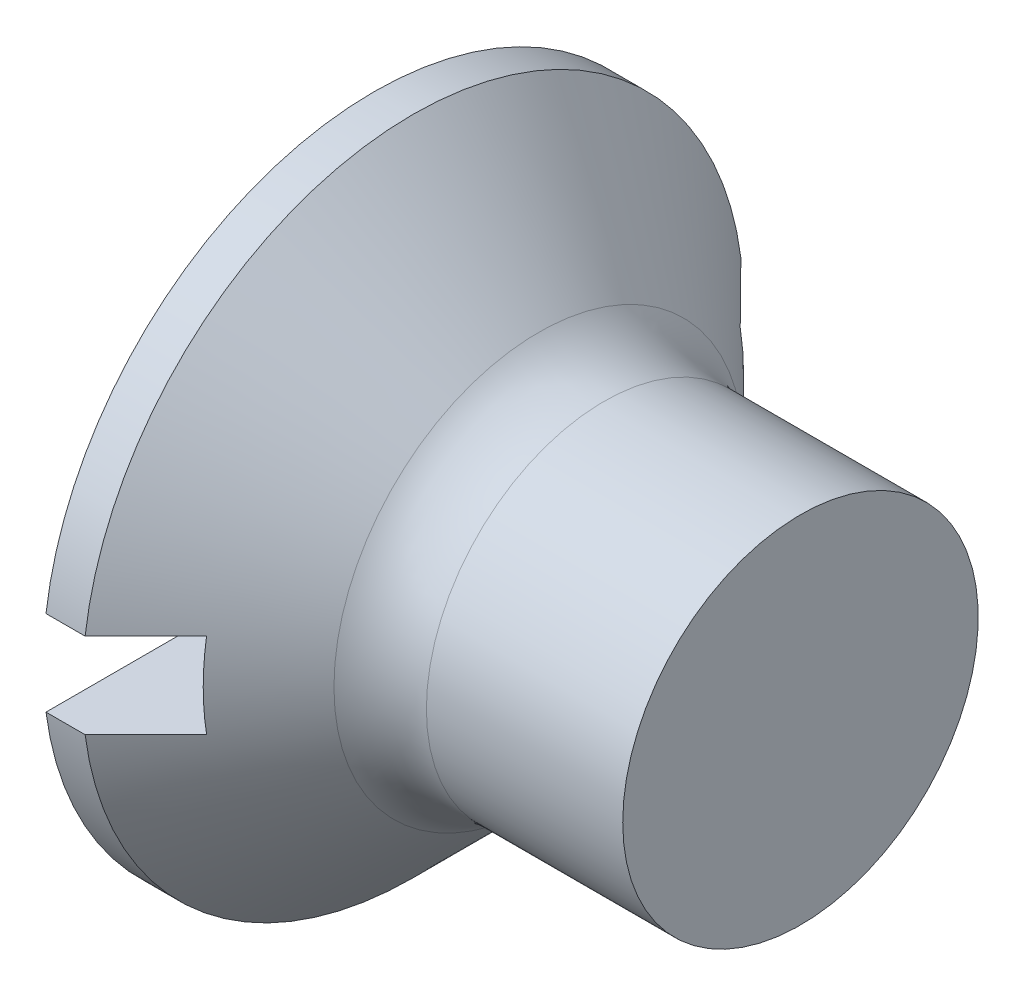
ISO-10303-21;
HEADER;
FILE_DESCRIPTION(('STEP AP214'),'2;1');
FILE_NAME('part.step','',(''),(''),'','','');
FILE_SCHEMA(('AUTOMOTIVE_DESIGN { 1 0 10303 214 1 1 1 1 }'));
ENDSEC;
DATA;
#1=APPLICATION_CONTEXT('core data for automotive mechanical design processes');
#2=APPLICATION_PROTOCOL_DEFINITION('international standard','automotive_design',2000,#1);
#3=PRODUCT_CONTEXT('',#1,'mechanical');
#4=PRODUCT('Part','Part','',(#3));
#5=PRODUCT_RELATED_PRODUCT_CATEGORY('part','',(#4));
#6=PRODUCT_DEFINITION_FORMATION('','',#4);
#7=PRODUCT_DEFINITION_CONTEXT('part definition',#1,'design');
#8=PRODUCT_DEFINITION('design','',#6,#7);
#9=PRODUCT_DEFINITION_SHAPE('','',#8);
#10=(LENGTH_UNIT() NAMED_UNIT(*) SI_UNIT(.MILLI.,.METRE.));
#11=(NAMED_UNIT(*) PLANE_ANGLE_UNIT() SI_UNIT($,.RADIAN.));
#12=(NAMED_UNIT(*) SI_UNIT($,.STERADIAN.) SOLID_ANGLE_UNIT());
#13=UNCERTAINTY_MEASURE_WITH_UNIT(LENGTH_MEASURE(1.E-05),#10,'distance_accuracy_value','');
#14=(GEOMETRIC_REPRESENTATION_CONTEXT(3) GLOBAL_UNCERTAINTY_ASSIGNED_CONTEXT((#13)) GLOBAL_UNIT_ASSIGNED_CONTEXT((#10,
#11,#12)) REPRESENTATION_CONTEXT('',''));
#15=CARTESIAN_POINT('',(0.,0.,0.));
#16=DIRECTION('',(0.,0.,1.));
#17=DIRECTION('',(1.,0.,0.));
#18=AXIS2_PLACEMENT_3D('',#15,#16,#17);
#19=CARTESIAN_POINT('',(-6.34999999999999,0.,0.));
#20=DIRECTION('',(-1.,0.,0.));
#21=DIRECTION('',(0.,0.,1.));
#22=AXIS2_PLACEMENT_3D('',#19,#20,#21);
#23=CYLINDRICAL_SURFACE('',#22,4.65);
#24=DIRECTION('',(-1.,0.,0.));
#25=VECTOR('',#24,1.);
#26=CARTESIAN_POINT('',(-6.34999999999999,0.599999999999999,-4.61112784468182));
#27=LINE('',#26,#25);
#28=CARTESIAN_POINT('',(0.,0.599999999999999,-4.61112784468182));
#29=VERTEX_POINT('',#28);
#30=CARTESIAN_POINT('',(0.550000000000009,0.599999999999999,-4.61112784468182));
#31=VERTEX_POINT('',#30);
#32=EDGE_CURVE('E55',#29,#31,#27,.F.);
#33=ORIENTED_EDGE('',*,*,#32,.F.);
#34=CARTESIAN_POINT('',(0.,0.,0.));
#35=DIRECTION('',(-1.,0.,0.));
#36=DIRECTION('',(0.,0.,1.));
#37=AXIS2_PLACEMENT_3D('',#34,#35,#36);
#38=CIRCLE('',#37,4.65);
#39=CARTESIAN_POINT('',(0.,0.600000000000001,4.61112784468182));
#40=VERTEX_POINT('',#39);
#41=EDGE_CURVE('E102',#40,#29,#38,.T.);
#42=ORIENTED_EDGE('',*,*,#41,.F.);
#43=DIRECTION('',(-1.,0.,0.));
#44=VECTOR('',#43,1.);
#45=CARTESIAN_POINT('',(-6.34999999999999,0.600000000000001,4.61112784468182));
#46=LINE('',#45,#44);
#47=CARTESIAN_POINT('',(0.550000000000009,0.600000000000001,4.61112784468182));
#48=VERTEX_POINT('',#47);
#49=EDGE_CURVE('E143',#48,#40,#46,.T.);
#50=ORIENTED_EDGE('',*,*,#49,.F.);
#51=CARTESIAN_POINT('',(0.550000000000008,0.,0.));
#52=DIRECTION('',(-1.,0.,0.));
#53=DIRECTION('',(0.,0.,1.));
#54=AXIS2_PLACEMENT_3D('',#51,#52,#53);
#55=CIRCLE('',#54,4.65);
#56=EDGE_CURVE('E111',#48,#31,#55,.T.);
#57=ORIENTED_EDGE('',*,*,#56,.T.);
#58=EDGE_LOOP('',(#33,#42,#50,#57));
#59=FACE_BOUND('',#58,.T.);
#60=ADVANCED_FACE('F32',(#59),#23,.T.);
#61=CARTESIAN_POINT('',(0.,0.,0.));
#62=DIRECTION('',(-1.,0.,0.));
#63=DIRECTION('',(0.,0.,1.));
#64=AXIS2_PLACEMENT_3D('',#61,#62,#63);
#65=PLANE('',#64);
#66=DIRECTION('',(0.,0.,-1.));
#67=VECTOR('',#66,1.);
#68=CARTESIAN_POINT('',(0.,0.6,0.));
#69=LINE('',#68,#67);
#70=EDGE_CURVE('E89',#40,#29,#69,.T.);
#71=ORIENTED_EDGE('',*,*,#70,.F.);
#72=ORIENTED_EDGE('',*,*,#41,.T.);
#73=EDGE_LOOP('',(#71,#72));
#74=FACE_BOUND('',#73,.T.);
#75=ADVANCED_FACE('F160',(#74),#65,.T.);
#76=CARTESIAN_POINT('',(6.,2.5,0.));
#77=DIRECTION('',(1.,0.,0.));
#78=DIRECTION('',(0.,0.,-1.));
#79=AXIS2_PLACEMENT_3D('',#76,#77,#78);
#80=PLANE('',#79);
#81=CARTESIAN_POINT('',(6.,0.,0.));
#82=DIRECTION('',(-1.,0.,0.));
#83=DIRECTION('',(0.,0.,1.));
#84=AXIS2_PLACEMENT_3D('',#81,#82,#83);
#85=CIRCLE('',#84,2.5);
#86=CARTESIAN_POINT('',(6.,0.,2.5));
#87=VERTEX_POINT('',#86);
#88=EDGE_CURVE('E112',#87,#87,#85,.T.);
#89=ORIENTED_EDGE('',*,*,#88,.F.);
#90=EDGE_LOOP('',(#89));
#91=FACE_BOUND('',#90,.T.);
#92=ADVANCED_FACE('F171',(#91),#80,.T.);
#93=CARTESIAN_POINT('',(-6.34999999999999,0.,0.));
#94=DIRECTION('',(-1.,0.,0.));
#95=DIRECTION('',(0.,0.,1.));
#96=AXIS2_PLACEMENT_3D('',#93,#94,#95);
#97=CYLINDRICAL_SURFACE('',#96,2.5);
#98=CARTESIAN_POINT('',(3.23847763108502,0.,0.));
#99=DIRECTION('',(-1.,0.,0.));
#100=DIRECTION('',(0.,0.,1.));
#101=AXIS2_PLACEMENT_3D('',#98,#99,#100);
#102=CIRCLE('',#101,2.5);
#103=CARTESIAN_POINT('',(3.23847763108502,0.,2.5));
#104=VERTEX_POINT('',#103);
#105=EDGE_CURVE('E90',#104,#104,#102,.F.);
#106=ORIENTED_EDGE('',*,*,#105,.T.);
#107=EDGE_LOOP('',(#106));
#108=FACE_BOUND('',#107,.T.);
#109=ORIENTED_EDGE('',*,*,#88,.T.);
#110=EDGE_LOOP('',(#109));
#111=FACE_BOUND('',#110,.T.);
#112=ADVANCED_FACE('F165',(#108,#111),#97,.T.);
#113=CARTESIAN_POINT('',(0.550000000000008,0.,0.));
#114=DIRECTION('',(-1.,0.,0.));
#115=DIRECTION('',(0.,0.,1.));
#116=AXIS2_PLACEMENT_3D('',#113,#114,#115);
#117=CONICAL_SURFACE('',#116,4.65,0.78539816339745);
#118=CARTESIAN_POINT('',(-5.05345798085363,0.599999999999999,-10.2358878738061));
#119=CARTESIAN_POINT('',(-4.7063338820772,0.599999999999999,-9.88816346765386));
#120=CARTESIAN_POINT('',(-4.35923588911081,0.599999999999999,-9.54041298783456));
#121=CARTESIAN_POINT('',(-3.66512028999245,0.599999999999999,-8.84482295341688));
#122=CARTESIAN_POINT('',(-3.31810268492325,0.599999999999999,-8.49698339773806));
#123=CARTESIAN_POINT('',(-2.6240861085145,0.599999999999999,-7.80108810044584));
#124=CARTESIAN_POINT('',(-2.27708717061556,0.599999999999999,-7.45303232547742));
#125=CARTESIAN_POINT('',(-1.58327190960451,0.599999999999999,-6.75674744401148));
#126=CARTESIAN_POINT('',(-1.23645558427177,0.599999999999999,-6.40851833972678));
#127=CARTESIAN_POINT('',(-0.530234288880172,0.599999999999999,-5.69884909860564));
#128=CARTESIAN_POINT('',(-0.170839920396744,0.599999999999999,-5.3373984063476));
#129=CARTESIAN_POINT('',(0.367846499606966,0.599999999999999,-4.79480605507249));
#130=CARTESIAN_POINT('',(0.547344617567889,0.599999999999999,-4.61386901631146));
#131=CARTESIAN_POINT('',(0.906142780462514,0.599999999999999,-4.251800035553));
#132=CARTESIAN_POINT('',(1.08544282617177,0.6,-4.07066809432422));
#133=CARTESIAN_POINT('',(1.44372217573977,0.6,-3.70815209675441));
#134=CARTESIAN_POINT('',(1.62270153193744,0.6,-3.52676809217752));
#135=CARTESIAN_POINT('',(1.98021132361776,0.6,-3.16355280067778));
#136=CARTESIAN_POINT('',(2.1587417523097,0.6,-2.98172150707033));
#137=CARTESIAN_POINT('',(2.51504600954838,0.6,-2.61734150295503));
#138=CARTESIAN_POINT('',(2.69281988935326,0.6,-2.43479284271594));
#139=CARTESIAN_POINT('',(2.95840184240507,0.6,-2.15993102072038));
#140=CARTESIAN_POINT('',(3.0467482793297,0.6,-2.06813839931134));
#141=CARTESIAN_POINT('',(3.22290791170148,0.6,-1.8840432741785));
#142=CARTESIAN_POINT('',(3.31072111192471,0.6,-1.79174077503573));
#143=CARTESIAN_POINT('',(3.44507973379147,0.6,-1.64924720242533));
#144=CARTESIAN_POINT('',(3.49191887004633,0.6,-1.59933324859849));
#145=CARTESIAN_POINT('',(3.58528403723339,0.6,-1.49921165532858));
#146=CARTESIAN_POINT('',(3.63181006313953,0.6,-1.44900401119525));
#147=CARTESIAN_POINT('',(3.72427703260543,0.6,-1.348388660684));
#148=CARTESIAN_POINT('',(3.77021949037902,0.6,-1.29798234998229));
#149=CARTESIAN_POINT('',(3.86152904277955,0.6,-1.19665513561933));
#150=CARTESIAN_POINT('',(3.90689615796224,0.6,-1.1457342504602));
#151=CARTESIAN_POINT('',(4.01209252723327,0.6,-1.02578570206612));
#152=CARTESIAN_POINT('',(4.07160553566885,0.6,-0.956477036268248));
#153=CARTESIAN_POINT('',(4.15917887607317,0.6,-0.850702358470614));
#154=CARTESIAN_POINT('',(4.18818199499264,0.6,-0.815019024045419));
#155=CARTESIAN_POINT('',(4.24528795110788,0.6,-0.742941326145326));
#156=CARTESIAN_POINT('',(4.27339088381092,0.6,-0.706547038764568));
#157=CARTESIAN_POINT('',(4.32869682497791,0.6,-0.632291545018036));
#158=CARTESIAN_POINT('',(4.35588213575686,0.6,-0.594417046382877));
#159=CARTESIAN_POINT('',(4.40832254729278,0.6,-0.517260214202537));
#160=CARTESIAN_POINT('',(4.43357498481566,0.6,-0.477976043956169));
#161=CARTESIAN_POINT('',(4.48075024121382,0.6,-0.397940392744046));
#162=CARTESIAN_POINT('',(4.50270366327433,0.6,-0.357207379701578));
#163=CARTESIAN_POINT('',(4.54164745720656,0.6,-0.273493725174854));
#164=CARTESIAN_POINT('',(4.55865364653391,0.6,-0.230520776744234));
#165=CARTESIAN_POINT('',(4.58372379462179,0.6,-0.145820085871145));
#166=CARTESIAN_POINT('',(4.59242377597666,0.6,-0.104295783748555));
#167=CARTESIAN_POINT('',(4.59893532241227,0.6,-0.0414391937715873));
#168=CARTESIAN_POINT('',(4.60002000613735,0.6,-0.0204304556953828));
#169=CARTESIAN_POINT('',(4.59997943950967,0.6,0.0215839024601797));
#170=CARTESIAN_POINT('',(4.59885411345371,0.6,0.0425895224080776));
#171=CARTESIAN_POINT('',(4.59227145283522,0.6,0.10501520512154));
#172=CARTESIAN_POINT('',(4.58363501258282,0.6,0.1461245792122));
#173=CARTESIAN_POINT('',(4.565808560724,0.6,0.206345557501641));
#174=CARTESIAN_POINT('',(4.55901965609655,0.6,0.226250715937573));
#175=CARTESIAN_POINT('',(4.54410905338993,0.6,0.265557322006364));
#176=CARTESIAN_POINT('',(4.53598757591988,0.6,0.284958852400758));
#177=CARTESIAN_POINT('',(4.51162458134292,0.6,0.33886087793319));
#178=CARTESIAN_POINT('',(4.49415337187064,0.6,0.372800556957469));
#179=CARTESIAN_POINT('',(4.45684225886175,0.6,0.439365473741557));
#180=CARTESIAN_POINT('',(4.436999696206,0.6,0.471989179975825));
#181=CARTESIAN_POINT('',(4.39563171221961,0.6,0.53629862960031));
#182=CARTESIAN_POINT('',(4.37410080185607,0.6,0.567980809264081));
#183=CARTESIAN_POINT('',(4.32989042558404,0.6,0.630537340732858));
#184=CARTESIAN_POINT('',(4.30721068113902,0.6,0.661411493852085));
#185=CARTESIAN_POINT('',(4.23751211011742,0.6,0.753681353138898));
#186=CARTESIAN_POINT('',(4.18923822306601,0.6,0.814124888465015));
#187=CARTESIAN_POINT('',(4.0909576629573,0.6,0.933321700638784));
#188=CARTESIAN_POINT('',(4.04095530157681,0.6,0.992078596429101));
#189=CARTESIAN_POINT('',(3.94086297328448,0.6,1.10735067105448));
#190=CARTESIAN_POINT('',(3.89079728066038,0.6,1.16388697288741));
#191=CARTESIAN_POINT('',(3.78992367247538,0.6,1.27629304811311));
#192=CARTESIAN_POINT('',(3.73911573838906,0.6,1.33216280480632));
#193=CARTESIAN_POINT('',(3.58591315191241,0.6,1.49908452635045));
#194=CARTESIAN_POINT('',(3.4827535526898,0.6,1.609433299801));
#195=CARTESIAN_POINT('',(3.27521830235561,0.6,1.82922471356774));
#196=CARTESIAN_POINT('',(3.17084134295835,0.6,1.93866611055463));
#197=CARTESIAN_POINT('',(2.96141984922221,0.6,2.15689179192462));
#198=CARTESIAN_POINT('',(2.85637536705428,0.6,2.26567612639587));
#199=CARTESIAN_POINT('',(2.64692360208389,0.6,2.481710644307));
#200=CARTESIAN_POINT('',(2.5425207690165,0.6,2.58896514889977));
#201=CARTESIAN_POINT('',(2.33341496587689,0.6,2.80318525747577));
#202=CARTESIAN_POINT('',(2.22871198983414,0.6,2.91015085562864));
#203=CARTESIAN_POINT('',(1.91438863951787,0.6,3.23063427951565));
#204=CARTESIAN_POINT('',(1.70445280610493,0.6,3.44384256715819));
#205=CARTESIAN_POINT('',(1.22510768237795,0.6,3.9295930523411));
#206=CARTESIAN_POINT('',(0.955548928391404,0.600000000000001,4.20198758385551));
#207=CARTESIAN_POINT('',(0.416004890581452,0.600000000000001,4.74635530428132));
#208=CARTESIAN_POINT('',(0.146019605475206,0.600000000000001,5.01832849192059));
#209=CARTESIAN_POINT('',(-0.664426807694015,0.600000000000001,5.83398149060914));
#210=CARTESIAN_POINT('',(-1.2052682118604,0.600000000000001,6.37728333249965));
#211=CARTESIAN_POINT('',(-2.297244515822,0.600000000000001,7.47334328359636));
#212=CARTESIAN_POINT('',(-2.84838746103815,0.600000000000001,8.02609337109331));
#213=CARTESIAN_POINT('',(-3.95082527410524,0.600000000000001,9.1312059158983));
#214=CARTESIAN_POINT('',(-4.5021200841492,0.600000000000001,9.683568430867));
#215=CARTESIAN_POINT('',(-5.05345798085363,0.600000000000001,10.2358878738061));
#216=B_SPLINE_CURVE_WITH_KNOTS('',3,(#118,#119,#120,#121,#122,#123,#124,#125,#126,#127,#128,
#129,#130,#131,#132,#133,#134,#135,#136,#137,#138,#139,#140,#141,#142,#143,#144,#145,#146,#147,
#148,#149,#150,#151,#152,#153,#154,#155,#156,#157,#158,#159,#160,#161,#162,#163,#164,#165,#166,
#167,#168,#169,#170,#171,#172,#173,#174,#175,#176,#177,#178,#179,#180,#181,#182,#183,#184,#185,
#186,#187,#188,#189,#190,#191,#192,#193,#194,#195,#196,#197,#198,#199,#200,#201,#202,#203,#204,
#205,#206,#207,#208,#209,#210,#211,#212,#213,#214,#215),.UNSPECIFIED.,.F.,.F.,(4,2,2,2,2,2,2,2,
2,2,2,2,2,2,2,2,2,2,2,2,2,2,2,2,2,2,2,2,2,2,2,2,2,2,2,2,2,2,2,2,2,2,2,2,2,2,2,2,4),(0.,
1.47399683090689,2.94801247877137,4.4224478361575,5.89686482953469,7.42601395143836,
8.19061836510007,8.95521977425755,9.71968231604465,10.4841563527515,11.2485777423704,
11.630779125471,12.0129770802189,12.2183239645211,12.4236741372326,12.6282760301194,
12.8328705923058,13.1068888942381,13.2448295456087,13.3827555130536,13.522578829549,
13.6625914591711,13.8012122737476,13.9393848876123,14.0658401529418,14.1288404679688,
14.1918429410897,14.3170190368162,14.3800826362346,14.4431358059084,14.557498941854,
14.6719915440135,14.7868731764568,14.9017827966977,15.1337679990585,15.365211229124,
15.5917537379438,15.8183019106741,16.2714608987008,16.7251625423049,17.1788291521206,
17.6278622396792,18.076904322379,18.9745538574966,20.1242253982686,21.2739004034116,
23.5737206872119,25.9154338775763,28.2566456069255),.UNSPECIFIED.);
#217=CARTESIAN_POINT('',(1.4,0.6,3.75233260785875));
#218=VERTEX_POINT('',#217);
#219=EDGE_CURVE('E107',#218,#48,#216,.T.);
#220=ORIENTED_EDGE('',*,*,#219,.F.);
#221=CARTESIAN_POINT('',(1.4,0.,0.));
#222=DIRECTION('',(1.,0.,0.));
#223=DIRECTION('',(0.,0.,-1.));
#224=AXIS2_PLACEMENT_3D('',#221,#222,#223);
#225=CIRCLE('',#224,3.80000000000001);
#226=CARTESIAN_POINT('',(1.4,-0.600000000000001,3.75233260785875));
#227=VERTEX_POINT('',#226);
#228=EDGE_CURVE('E11',#227,#218,#225,.F.);
#229=ORIENTED_EDGE('',*,*,#228,.F.);
#230=CARTESIAN_POINT('',(-5.05345798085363,-0.600000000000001,10.2358878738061));
#231=CARTESIAN_POINT('',(-4.7063338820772,-0.600000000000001,9.88816346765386));
#232=CARTESIAN_POINT('',(-4.35923588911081,-0.600000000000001,9.54041298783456));
#233=CARTESIAN_POINT('',(-3.66512028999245,-0.600000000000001,8.84482295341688));
#234=CARTESIAN_POINT('',(-3.31810268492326,-0.600000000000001,8.49698339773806));
#235=CARTESIAN_POINT('',(-2.6240861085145,-0.600000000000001,7.80108810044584));
#236=CARTESIAN_POINT('',(-2.27708717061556,-0.600000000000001,7.45303232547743));
#237=CARTESIAN_POINT('',(-1.58327190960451,-0.600000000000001,6.75674744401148));
#238=CARTESIAN_POINT('',(-1.23645558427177,-0.600000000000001,6.40851833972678));
#239=CARTESIAN_POINT('',(-0.530234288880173,-0.600000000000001,5.69884909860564));
#240=CARTESIAN_POINT('',(-0.170839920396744,-0.600000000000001,5.3373984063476));
#241=CARTESIAN_POINT('',(0.367846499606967,-0.600000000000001,4.79480605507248));
#242=CARTESIAN_POINT('',(0.547344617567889,-0.600000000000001,4.61386901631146));
#243=CARTESIAN_POINT('',(0.906142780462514,-0.600000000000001,4.251800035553));
#244=CARTESIAN_POINT('',(1.08544282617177,-0.600000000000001,4.07066809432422));
#245=CARTESIAN_POINT('',(1.44372217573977,-0.600000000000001,3.70815209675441));
#246=CARTESIAN_POINT('',(1.62270153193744,-0.600000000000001,3.52676809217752));
#247=CARTESIAN_POINT('',(1.98021132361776,-0.600000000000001,3.16355280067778));
#248=CARTESIAN_POINT('',(2.1587417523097,-0.600000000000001,2.98172150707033));
#249=CARTESIAN_POINT('',(2.51504600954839,-0.600000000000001,2.61734150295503));
#250=CARTESIAN_POINT('',(2.69281988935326,-0.600000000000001,2.43479284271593));
#251=CARTESIAN_POINT('',(2.95840184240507,-0.600000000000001,2.15993102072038));
#252=CARTESIAN_POINT('',(3.0467482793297,-0.600000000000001,2.06813839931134));
#253=CARTESIAN_POINT('',(3.22290791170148,-0.600000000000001,1.8840432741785));
#254=CARTESIAN_POINT('',(3.31072111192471,-0.600000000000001,1.79174077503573));
#255=CARTESIAN_POINT('',(3.44507973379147,-0.600000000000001,1.64924720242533));
#256=CARTESIAN_POINT('',(3.49191887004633,-0.600000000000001,1.59933324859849));
#257=CARTESIAN_POINT('',(3.58528403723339,-0.600000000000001,1.49921165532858));
#258=CARTESIAN_POINT('',(3.63181006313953,-0.600000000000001,1.44900401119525));
#259=CARTESIAN_POINT('',(3.72427703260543,-0.600000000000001,1.348388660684));
#260=CARTESIAN_POINT('',(3.77021949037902,-0.600000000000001,1.29798234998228));
#261=CARTESIAN_POINT('',(3.86152904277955,-0.600000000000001,1.19665513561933));
#262=CARTESIAN_POINT('',(3.90689615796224,-0.600000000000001,1.1457342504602));
#263=CARTESIAN_POINT('',(4.01209252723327,-0.600000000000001,1.02578570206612));
#264=CARTESIAN_POINT('',(4.07160553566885,-0.600000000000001,0.956477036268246));
#265=CARTESIAN_POINT('',(4.15917887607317,-0.600000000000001,0.850702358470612));
#266=CARTESIAN_POINT('',(4.18818199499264,-0.600000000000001,0.815019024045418));
#267=CARTESIAN_POINT('',(4.24528795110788,-0.600000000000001,0.742941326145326));
#268=CARTESIAN_POINT('',(4.27339088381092,-0.600000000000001,0.706547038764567));
#269=CARTESIAN_POINT('',(4.32869682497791,-0.600000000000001,0.632291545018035));
#270=CARTESIAN_POINT('',(4.35588213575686,-0.600000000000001,0.594417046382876));
#271=CARTESIAN_POINT('',(4.40832254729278,-0.600000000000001,0.517260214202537));
#272=CARTESIAN_POINT('',(4.43357498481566,-0.600000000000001,0.477976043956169));
#273=CARTESIAN_POINT('',(4.48075024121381,-0.600000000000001,0.397940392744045));
#274=CARTESIAN_POINT('',(4.50270366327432,-0.600000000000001,0.357207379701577));
#275=CARTESIAN_POINT('',(4.54164745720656,-0.600000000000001,0.273493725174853));
#276=CARTESIAN_POINT('',(4.55865364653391,-0.600000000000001,0.230520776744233));
#277=CARTESIAN_POINT('',(4.58372379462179,-0.600000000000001,0.145820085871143));
#278=CARTESIAN_POINT('',(4.59242377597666,-0.600000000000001,0.104295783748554));
#279=CARTESIAN_POINT('',(4.59893532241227,-0.600000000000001,0.0414391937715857));
#280=CARTESIAN_POINT('',(4.60002000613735,-0.600000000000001,0.0204304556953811));
#281=CARTESIAN_POINT('',(4.59997943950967,-0.600000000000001,-0.0215839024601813));
#282=CARTESIAN_POINT('',(4.59885411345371,-0.600000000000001,-0.0425895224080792));
#283=CARTESIAN_POINT('',(4.59227145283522,-0.600000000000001,-0.105015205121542));
#284=CARTESIAN_POINT('',(4.58363501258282,-0.600000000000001,-0.146124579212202));
#285=CARTESIAN_POINT('',(4.565808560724,-0.600000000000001,-0.206345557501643));
#286=CARTESIAN_POINT('',(4.55901965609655,-0.600000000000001,-0.226250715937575));
#287=CARTESIAN_POINT('',(4.54410905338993,-0.600000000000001,-0.265557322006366));
#288=CARTESIAN_POINT('',(4.53598757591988,-0.600000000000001,-0.284958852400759));
#289=CARTESIAN_POINT('',(4.51162458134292,-0.600000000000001,-0.338860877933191));
#290=CARTESIAN_POINT('',(4.49415337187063,-0.600000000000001,-0.37280055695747));
#291=CARTESIAN_POINT('',(4.45684225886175,-0.600000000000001,-0.439365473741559));
#292=CARTESIAN_POINT('',(4.43699969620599,-0.600000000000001,-0.471989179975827));
#293=CARTESIAN_POINT('',(4.3956317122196,-0.600000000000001,-0.536298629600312));
#294=CARTESIAN_POINT('',(4.37410080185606,-0.600000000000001,-0.567980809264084));
#295=CARTESIAN_POINT('',(4.32989042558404,-0.600000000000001,-0.630537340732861));
#296=CARTESIAN_POINT('',(4.30721068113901,-0.600000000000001,-0.661411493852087));
#297=CARTESIAN_POINT('',(4.23751211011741,-0.600000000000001,-0.753681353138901));
#298=CARTESIAN_POINT('',(4.18923822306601,-0.600000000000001,-0.814124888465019));
#299=CARTESIAN_POINT('',(4.09095766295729,-0.600000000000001,-0.933321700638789));
#300=CARTESIAN_POINT('',(4.04095530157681,-0.600000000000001,-0.992078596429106));
#301=CARTESIAN_POINT('',(3.94086297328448,-0.600000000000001,-1.10735067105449));
#302=CARTESIAN_POINT('',(3.89079728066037,-0.600000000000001,-1.16388697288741));
#303=CARTESIAN_POINT('',(3.78992367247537,-0.600000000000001,-1.27629304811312));
#304=CARTESIAN_POINT('',(3.73911573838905,-0.600000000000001,-1.33216280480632));
#305=CARTESIAN_POINT('',(3.5859131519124,-0.600000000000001,-1.49908452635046));
#306=CARTESIAN_POINT('',(3.48275355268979,-0.600000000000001,-1.60943329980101));
#307=CARTESIAN_POINT('',(3.2752183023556,-0.600000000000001,-1.82922471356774));
#308=CARTESIAN_POINT('',(3.17084134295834,-0.600000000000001,-1.93866611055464));
#309=CARTESIAN_POINT('',(2.9614198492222,-0.600000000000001,-2.15689179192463));
#310=CARTESIAN_POINT('',(2.85637536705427,-0.600000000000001,-2.26567612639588));
#311=CARTESIAN_POINT('',(2.64692360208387,-0.600000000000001,-2.48171064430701));
#312=CARTESIAN_POINT('',(2.54252076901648,-0.600000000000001,-2.58896514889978));
#313=CARTESIAN_POINT('',(2.33341496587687,-0.600000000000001,-2.80318525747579));
#314=CARTESIAN_POINT('',(2.22871198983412,-0.600000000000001,-2.91015085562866));
#315=CARTESIAN_POINT('',(1.91438863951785,-0.600000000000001,-3.23063427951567));
#316=CARTESIAN_POINT('',(1.70445280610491,-0.600000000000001,-3.44384256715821));
#317=CARTESIAN_POINT('',(1.22510768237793,-0.600000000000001,-3.92959305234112));
#318=CARTESIAN_POINT('',(0.955548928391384,-0.600000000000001,-4.20198758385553));
#319=CARTESIAN_POINT('',(0.416004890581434,-0.600000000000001,-4.74635530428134));
#320=CARTESIAN_POINT('',(0.146019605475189,-0.600000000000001,-5.01832849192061));
#321=CARTESIAN_POINT('',(-0.66442680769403,-0.600000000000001,-5.83398149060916));
#322=CARTESIAN_POINT('',(-1.20526821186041,-0.600000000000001,-6.37728333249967));
#323=CARTESIAN_POINT('',(-2.29724451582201,-0.600000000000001,-7.47334328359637));
#324=CARTESIAN_POINT('',(-2.84838746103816,-0.600000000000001,-8.02609337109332));
#325=CARTESIAN_POINT('',(-3.95082527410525,-0.600000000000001,-9.13120591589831));
#326=CARTESIAN_POINT('',(-4.5021200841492,-0.600000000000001,-9.68356843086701));
#327=CARTESIAN_POINT('',(-5.05345798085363,-0.600000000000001,-10.2358878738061));
#328=B_SPLINE_CURVE_WITH_KNOTS('',3,(#230,#231,#232,#233,#234,#235,#236,#237,#238,#239,#240,
#241,#242,#243,#244,#245,#246,#247,#248,#249,#250,#251,#252,#253,#254,#255,#256,#257,#258,#259,
#260,#261,#262,#263,#264,#265,#266,#267,#268,#269,#270,#271,#272,#273,#274,#275,#276,#277,#278,
#279,#280,#281,#282,#283,#284,#285,#286,#287,#288,#289,#290,#291,#292,#293,#294,#295,#296,#297,
#298,#299,#300,#301,#302,#303,#304,#305,#306,#307,#308,#309,#310,#311,#312,#313,#314,#315,#316,
#317,#318,#319,#320,#321,#322,#323,#324,#325,#326,#327),.UNSPECIFIED.,.F.,.F.,(4,2,2,2,2,2,2,2,
2,2,2,2,2,2,2,2,2,2,2,2,2,2,2,2,2,2,2,2,2,2,2,2,2,2,2,2,2,2,2,2,2,2,2,2,2,2,2,2,4),(0.,
1.47399683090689,2.94801247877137,4.4224478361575,5.89686482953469,7.42601395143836,
8.19061836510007,8.95521977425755,9.71968231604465,10.4841563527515,11.2485777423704,
11.630779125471,12.0129770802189,12.2183239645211,12.4236741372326,12.6282760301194,
12.8328705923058,13.1068888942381,13.2448295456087,13.3827555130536,13.522578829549,
13.6625914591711,13.8012122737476,13.9393848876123,14.0658401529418,14.1288404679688,
14.1918429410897,14.3170190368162,14.3800826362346,14.4431358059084,14.557498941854,
14.6719915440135,14.7868731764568,14.9017827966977,15.1337679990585,15.365211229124,
15.5917537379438,15.8183019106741,16.2714608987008,16.7251625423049,17.1788291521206,
17.6278622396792,18.076904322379,18.9745538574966,20.1242253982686,21.2739004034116,
23.5737206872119,25.9154338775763,28.2566456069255),.UNSPECIFIED.);
#329=CARTESIAN_POINT('',(0.550000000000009,-0.600000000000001,4.61112784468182));
#330=VERTEX_POINT('',#329);
#331=EDGE_CURVE('E98',#330,#227,#328,.T.);
#332=ORIENTED_EDGE('',*,*,#331,.F.);
#333=CARTESIAN_POINT('',(0.550000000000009,-0.600000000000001,-4.61112784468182));
#334=VERTEX_POINT('',#333);
#335=EDGE_CURVE('E97',#334,#330,#55,.T.);
#336=ORIENTED_EDGE('',*,*,#335,.F.);
#337=CARTESIAN_POINT('',(1.4,-0.600000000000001,-3.75233260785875));
#338=VERTEX_POINT('',#337);
#339=EDGE_CURVE('E99',#338,#334,#328,.T.);
#340=ORIENTED_EDGE('',*,*,#339,.F.);
#341=CARTESIAN_POINT('',(1.4,0.6,-3.75233260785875));
#342=VERTEX_POINT('',#341);
#343=EDGE_CURVE('E36',#342,#338,#225,.F.);
#344=ORIENTED_EDGE('',*,*,#343,.F.);
#345=EDGE_CURVE('E103',#31,#342,#216,.T.);
#346=ORIENTED_EDGE('',*,*,#345,.F.);
#347=ORIENTED_EDGE('',*,*,#56,.F.);
#348=EDGE_LOOP('',(#220,#229,#332,#336,#340,#344,#346,#347));
#349=FACE_BOUND('',#348,.T.);
#350=CARTESIAN_POINT('',(2.31923881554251,0.,0.));
#351=DIRECTION('',(-1.,0.,0.));
#352=DIRECTION('',(0.,0.,1.));
#353=AXIS2_PLACEMENT_3D('',#350,#351,#352);
#354=CIRCLE('',#353,2.88076118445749);
#355=CARTESIAN_POINT('',(2.31923881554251,0.,2.88076118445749));
#356=VERTEX_POINT('',#355);
#357=EDGE_CURVE('E115',#356,#356,#354,.T.);
#358=ORIENTED_EDGE('',*,*,#357,.T.);
#359=EDGE_LOOP('',(#358));
#360=FACE_BOUND('',#359,.T.);
#361=ADVANCED_FACE('F134',(#349,#360),#117,.T.);
#362=DIRECTION('',(-1.,0.,0.));
#363=VECTOR('',#362,1.);
#364=CARTESIAN_POINT('',(-6.34999999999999,-0.600000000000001,4.61112784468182));
#365=LINE('',#364,#363);
#366=CARTESIAN_POINT('',(0.,-0.600000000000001,4.61112784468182));
#367=VERTEX_POINT('',#366);
#368=EDGE_CURVE('E84',#367,#330,#365,.F.);
#369=ORIENTED_EDGE('',*,*,#368,.F.);
#370=CARTESIAN_POINT('',(0.,-0.600000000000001,-4.61112784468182));
#371=VERTEX_POINT('',#370);
#372=EDGE_CURVE('E95',#371,#367,#38,.T.);
#373=ORIENTED_EDGE('',*,*,#372,.F.);
#374=DIRECTION('',(-1.,0.,0.));
#375=VECTOR('',#374,1.);
#376=CARTESIAN_POINT('',(-6.34999999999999,-0.600000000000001,-4.61112784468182));
#377=LINE('',#376,#375);
#378=EDGE_CURVE('E47',#334,#371,#377,.T.);
#379=ORIENTED_EDGE('',*,*,#378,.F.);
#380=ORIENTED_EDGE('',*,*,#335,.T.);
#381=EDGE_LOOP('',(#369,#373,#379,#380));
#382=FACE_BOUND('',#381,.T.);
#383=ADVANCED_FACE('F94',(#382),#23,.T.);
#384=DIRECTION('',(0.,0.,1.));
#385=VECTOR('',#384,1.);
#386=CARTESIAN_POINT('',(0.,-0.600000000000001,0.));
#387=LINE('',#386,#385);
#388=EDGE_CURVE('E81',#371,#367,#387,.T.);
#389=ORIENTED_EDGE('',*,*,#388,.F.);
#390=ORIENTED_EDGE('',*,*,#372,.T.);
#391=EDGE_LOOP('',(#389,#390));
#392=FACE_BOUND('',#391,.T.);
#393=ADVANCED_FACE('F101',(#392),#65,.T.);
#394=CARTESIAN_POINT('',(3.23847763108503,0.,0.));
#395=DIRECTION('',(-1.,0.,0.));
#396=DIRECTION('',(0.,0.,1.));
#397=AXIS2_PLACEMENT_3D('',#394,#395,#396);
#398=TOROIDAL_SURFACE('',#397,3.8,1.3);
#399=ORIENTED_EDGE('',*,*,#105,.F.);
#400=EDGE_LOOP('',(#399));
#401=FACE_BOUND('',#400,.T.);
#402=ORIENTED_EDGE('',*,*,#357,.F.);
#403=EDGE_LOOP('',(#402));
#404=FACE_BOUND('',#403,.T.);
#405=ADVANCED_FACE('F34',(#401,#404),#398,.F.);
#406=CARTESIAN_POINT('',(1.4,0.600000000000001,4.65));
#407=DIRECTION('',(0.,1.,0.));
#408=DIRECTION('',(0.,0.,1.));
#409=AXIS2_PLACEMENT_3D('',#406,#407,#408);
#410=PLANE('',#409);
#411=ORIENTED_EDGE('',*,*,#345,.T.);
#412=DIRECTION('',(0.,0.,-1.));
#413=VECTOR('',#412,1.);
#414=CARTESIAN_POINT('',(1.4,0.600000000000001,4.65));
#415=LINE('',#414,#413);
#416=EDGE_CURVE('E129',#218,#342,#415,.T.);
#417=ORIENTED_EDGE('',*,*,#416,.F.);
#418=ORIENTED_EDGE('',*,*,#219,.T.);
#419=ORIENTED_EDGE('',*,*,#49,.T.);
#420=ORIENTED_EDGE('',*,*,#70,.T.);
#421=ORIENTED_EDGE('',*,*,#32,.T.);
#422=EDGE_LOOP('',(#411,#417,#418,#419,#420,#421));
#423=FACE_BOUND('',#422,.T.);
#424=ADVANCED_FACE('F153',(#423),#410,.F.);
#425=CARTESIAN_POINT('',(1.4,-0.600000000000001,-4.65));
#426=DIRECTION('',(0.,-1.,0.));
#427=DIRECTION('',(0.,0.,-1.));
#428=AXIS2_PLACEMENT_3D('',#425,#426,#427);
#429=PLANE('',#428);
#430=ORIENTED_EDGE('',*,*,#331,.T.);
#431=DIRECTION('',(0.,0.,1.));
#432=VECTOR('',#431,1.);
#433=CARTESIAN_POINT('',(1.4,-0.600000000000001,-4.65));
#434=LINE('',#433,#432);
#435=EDGE_CURVE('E126',#338,#227,#434,.T.);
#436=ORIENTED_EDGE('',*,*,#435,.F.);
#437=ORIENTED_EDGE('',*,*,#339,.T.);
#438=ORIENTED_EDGE('',*,*,#378,.T.);
#439=ORIENTED_EDGE('',*,*,#388,.T.);
#440=ORIENTED_EDGE('',*,*,#368,.T.);
#441=EDGE_LOOP('',(#430,#436,#437,#438,#439,#440));
#442=FACE_BOUND('',#441,.T.);
#443=ADVANCED_FACE('F83',(#442),#429,.F.);
#444=CARTESIAN_POINT('',(1.4,-0.600000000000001,-4.65));
#445=DIRECTION('',(1.,0.,0.));
#446=DIRECTION('',(0.,0.,-1.));
#447=AXIS2_PLACEMENT_3D('',#444,#445,#446);
#448=PLANE('',#447);
#449=ORIENTED_EDGE('',*,*,#228,.T.);
#450=ORIENTED_EDGE('',*,*,#416,.T.);
#451=ORIENTED_EDGE('',*,*,#343,.T.);
#452=ORIENTED_EDGE('',*,*,#435,.T.);
#453=EDGE_LOOP('',(#449,#450,#451,#452));
#454=FACE_BOUND('',#453,.T.);
#455=ADVANCED_FACE('F125',(#454),#448,.F.);
#456=CLOSED_SHELL('',(#60,#75,#92,#112,#361,#383,#393,#405,#424,#443,#455));
#457=MANIFOLD_SOLID_BREP('B2',#456);
#458=ADVANCED_BREP_SHAPE_REPRESENTATION('',(#18,#457),#14);
#459=SHAPE_DEFINITION_REPRESENTATION(#9,#458);
ENDSEC;
END-ISO-10303-21;
